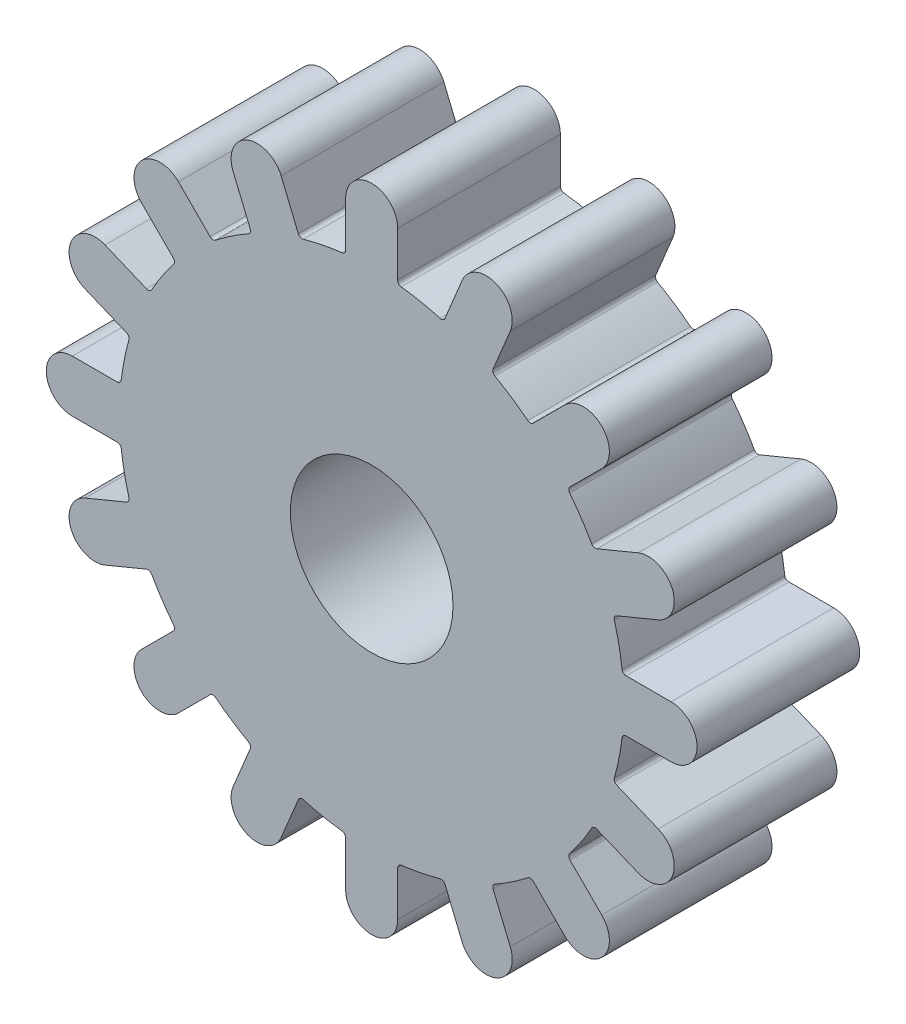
from build123d import *

# Parameters (mm, degrees)
SKETCH1_R           = 5
BOSS_EXTRUDE1_DEPTH = 10


with BuildPart() as part:
    # Sketch1 → Boss-Extrude1 (new body)
    with BuildSketch(Plane.XY):
        with BuildLine():
            Line((-1.6, 18.4), (-1.6, 15.640971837))
            ThreePointArc((-1.6, 15.640971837), (-1.663129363, 15.474901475), (-1.820634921, 15.392702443))
            ThreePointArc((-1.820634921, 15.392702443), (-3.023899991, 15.202171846), (-4.208484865, 14.917729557))
            ThreePointArc((-4.208484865, 14.917729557), (-4.385457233, 14.933396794), (-4.507333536, 15.06266724))
            Line((-4.507333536, 15.06266724), (-5.563167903, 17.61167689))
            ThreePointArc((-5.563167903, 17.61167689), (-7.653668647, 18.47759065), (-8.519582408, 16.387089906))
            Line((-8.519582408, 16.387089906), (-7.46374804, 13.838080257))
            ThreePointArc((-7.46374804, 13.838080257), (-7.45851959, 13.660492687), (-7.572579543, 13.524275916))
            ThreePointArc((-7.572579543, 13.524275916), (-8.611338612, 12.887778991), (-9.596900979, 12.171667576))
            ThreePointArc((-9.596900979, 12.171667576), (-9.76639772, 12.118417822), (-9.9284664, 12.1912081))
            Line((-9.9284664, 12.1912081), (-11.879393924, 14.142135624))
            ThreePointArc((-11.879393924, 14.142135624), (-14.142135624, 14.142135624), (-14.142135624, 11.879393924))
            Line((-14.142135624, 11.879393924), (-12.1912081, 9.9284664))
            ThreePointArc((-12.1912081, 9.9284664), (-12.118417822, 9.76639772), (-12.171667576, 9.596900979))
            ThreePointArc((-12.171667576, 9.596900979), (-12.887778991, 8.611338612), (-13.524275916, 7.572579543))
            ThreePointArc((-13.524275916, 7.572579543), (-13.660492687, 7.45851959), (-13.838080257, 7.46374804))
            Line((-13.838080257, 7.46374804), (-16.387089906, 8.519582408))
            ThreePointArc((-16.387089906, 8.519582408), (-18.47759065, 7.653668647), (-17.61167689, 5.563167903))
            Line((-17.61167689, 5.563167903), (-15.06266724, 4.507333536))
            ThreePointArc((-15.06266724, 4.507333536), (-14.933396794, 4.385457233), (-14.917729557, 4.208484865))
            ThreePointArc((-14.917729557, 4.208484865), (-15.202171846, 3.023899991), (-15.392702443, 1.820634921))
            ThreePointArc((-15.392702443, 1.820634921), (-15.474901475, 1.663129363), (-15.640971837, 1.6))
            Line((-15.640971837, 1.6), (-18.4, 1.6))
            ThreePointArc((-18.4, 1.6), (-20, 0), (-18.4, -1.6))
            Line((-18.4, -1.6), (-15.640971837, -1.6))
            ThreePointArc((-15.640971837, -1.6), (-15.474901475, -1.663129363), (-15.392702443, -1.820634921))
            ThreePointArc((-15.392702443, -1.820634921), (-15.202171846, -3.023899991), (-14.917729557, -4.208484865))
            ThreePointArc((-14.917729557, -4.208484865), (-14.933396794, -4.385457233), (-15.06266724, -4.507333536))
            Line((-15.06266724, -4.507333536), (-17.61167689, -5.563167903))
            ThreePointArc((-17.61167689, -5.563167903), (-18.47759065, -7.653668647), (-16.387089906, -8.519582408))
            Line((-16.387089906, -8.519582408), (-13.838080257, -7.46374804))
            ThreePointArc((-13.838080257, -7.46374804), (-13.660492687, -7.45851959), (-13.524275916, -7.572579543))
            ThreePointArc((-13.524275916, -7.572579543), (-12.887778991, -8.611338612), (-12.171667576, -9.596900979))
            ThreePointArc((-12.171667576, -9.596900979), (-12.118417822, -9.76639772), (-12.1912081, -9.9284664))
            Line((-12.1912081, -9.9284664), (-14.142135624, -11.879393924))
            ThreePointArc((-14.142135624, -11.879393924), (-14.142135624, -14.142135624), (-11.879393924, -14.142135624))
            Line((-11.879393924, -14.142135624), (-9.9284664, -12.1912081))
            ThreePointArc((-9.9284664, -12.1912081), (-9.76639772, -12.118417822), (-9.596900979, -12.171667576))
            ThreePointArc((-9.596900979, -12.171667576), (-8.611338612, -12.887778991), (-7.572579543, -13.524275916))
            ThreePointArc((-7.572579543, -13.524275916), (-7.45851959, -13.660492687), (-7.46374804, -13.838080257))
            Line((-7.46374804, -13.838080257), (-8.519582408, -16.387089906))
            ThreePointArc((-8.519582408, -16.387089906), (-7.653668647, -18.47759065), (-5.563167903, -17.61167689))
            Line((-5.563167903, -17.61167689), (-4.507333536, -15.06266724))
            ThreePointArc((-4.507333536, -15.06266724), (-4.385457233, -14.933396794), (-4.208484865, -14.917729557))
            ThreePointArc((-4.208484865, -14.917729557), (-3.023899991, -15.202171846), (-1.820634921, -15.392702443))
            ThreePointArc((-1.820634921, -15.392702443), (-1.663129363, -15.474901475), (-1.6, -15.640971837))
            Line((-1.6, -15.640971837), (-1.6, -18.4))
            ThreePointArc((-1.6, -18.4), (0, -20), (1.6, -18.4))
            Line((1.6, -18.4), (1.6, -15.640971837))
            ThreePointArc((1.6, -15.640971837), (1.663129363, -15.474901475), (1.820634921, -15.392702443))
            ThreePointArc((1.820634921, -15.392702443), (3.023899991, -15.202171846), (4.208484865, -14.917729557))
            ThreePointArc((4.208484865, -14.917729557), (4.385457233, -14.933396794), (4.507333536, -15.06266724))
            Line((4.507333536, -15.06266724), (5.563167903, -17.61167689))
            ThreePointArc((5.563167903, -17.61167689), (7.653668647, -18.47759065), (8.519582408, -16.387089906))
            Line((8.519582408, -16.387089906), (7.46374804, -13.838080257))
            ThreePointArc((7.46374804, -13.838080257), (7.45851959, -13.660492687), (7.572579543, -13.524275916))
            ThreePointArc((7.572579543, -13.524275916), (8.611338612, -12.887778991), (9.596900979, -12.171667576))
            ThreePointArc((9.596900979, -12.171667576), (9.76639772, -12.118417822), (9.9284664, -12.1912081))
            Line((9.9284664, -12.1912081), (11.879393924, -14.142135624))
            ThreePointArc((11.879393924, -14.142135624), (14.142135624, -14.142135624), (14.142135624, -11.879393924))
            Line((14.142135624, -11.879393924), (12.1912081, -9.9284664))
            ThreePointArc((12.1912081, -9.9284664), (12.118417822, -9.76639772), (12.171667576, -9.596900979))
            ThreePointArc((12.171667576, -9.596900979), (12.887778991, -8.611338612), (13.524275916, -7.572579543))
            ThreePointArc((13.524275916, -7.572579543), (13.660492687, -7.45851959), (13.838080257, -7.46374804))
            Line((13.838080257, -7.46374804), (16.387089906, -8.519582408))
            ThreePointArc((16.387089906, -8.519582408), (18.47759065, -7.653668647), (17.61167689, -5.563167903))
            Line((17.61167689, -5.563167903), (15.06266724, -4.507333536))
            ThreePointArc((15.06266724, -4.507333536), (14.933396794, -4.385457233), (14.917729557, -4.208484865))
            ThreePointArc((14.917729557, -4.208484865), (15.202171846, -3.023899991), (15.392702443, -1.820634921))
            ThreePointArc((15.392702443, -1.820634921), (15.474901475, -1.663129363), (15.640971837, -1.6))
            Line((15.640971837, -1.6), (18.4, -1.6))
            ThreePointArc((18.4, -1.6), (20, 0), (18.4, 1.6))
            Line((18.4, 1.6), (15.640971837, 1.6))
            ThreePointArc((15.640971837, 1.6), (15.474901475, 1.663129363), (15.392702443, 1.820634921))
            ThreePointArc((15.392702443, 1.820634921), (15.202171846, 3.023899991), (14.917729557, 4.208484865))
            ThreePointArc((14.917729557, 4.208484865), (14.933396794, 4.385457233), (15.06266724, 4.507333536))
            Line((15.06266724, 4.507333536), (17.61167689, 5.563167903))
            ThreePointArc((17.61167689, 5.563167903), (18.47759065, 7.653668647), (16.387089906, 8.519582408))
            Line((16.387089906, 8.519582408), (13.838080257, 7.46374804))
            ThreePointArc((13.838080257, 7.46374804), (13.660492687, 7.45851959), (13.524275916, 7.572579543))
            ThreePointArc((13.524275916, 7.572579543), (12.887778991, 8.611338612), (12.171667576, 9.596900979))
            ThreePointArc((12.171667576, 9.596900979), (12.118417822, 9.76639772), (12.1912081, 9.9284664))
            Line((12.1912081, 9.9284664), (14.142135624, 11.879393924))
            ThreePointArc((14.142135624, 11.879393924), (14.142135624, 14.142135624), (11.879393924, 14.142135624))
            Line((11.879393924, 14.142135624), (9.9284664, 12.1912081))
            ThreePointArc((9.9284664, 12.1912081), (9.76639772, 12.118417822), (9.596900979, 12.171667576))
            ThreePointArc((9.596900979, 12.171667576), (8.611338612, 12.887778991), (7.572579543, 13.524275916))
            ThreePointArc((7.572579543, 13.524275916), (7.45851959, 13.660492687), (7.46374804, 13.838080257))
            Line((7.46374804, 13.838080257), (8.519582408, 16.387089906))
            ThreePointArc((8.519582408, 16.387089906), (7.653668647, 18.47759065), (5.563167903, 17.61167689))
            Line((5.563167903, 17.61167689), (4.507333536, 15.06266724))
            ThreePointArc((4.507333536, 15.06266724), (4.385457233, 14.933396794), (4.208484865, 14.917729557))
            ThreePointArc((4.208484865, 14.917729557), (3.023899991, 15.202171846), (1.820634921, 15.392702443))
            ThreePointArc((1.820634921, 15.392702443), (1.663129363, 15.474901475), (1.6, 15.640971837))
            Line((1.6, 15.640971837), (1.6, 18.4))
            ThreePointArc((1.6, 18.4), (0, 20), (-1.6, 18.4))
        make_face()
        Circle(SKETCH1_R, mode=Mode.SUBTRACT)
    extrude(amount=BOSS_EXTRUDE1_DEPTH)


solid = part.part
